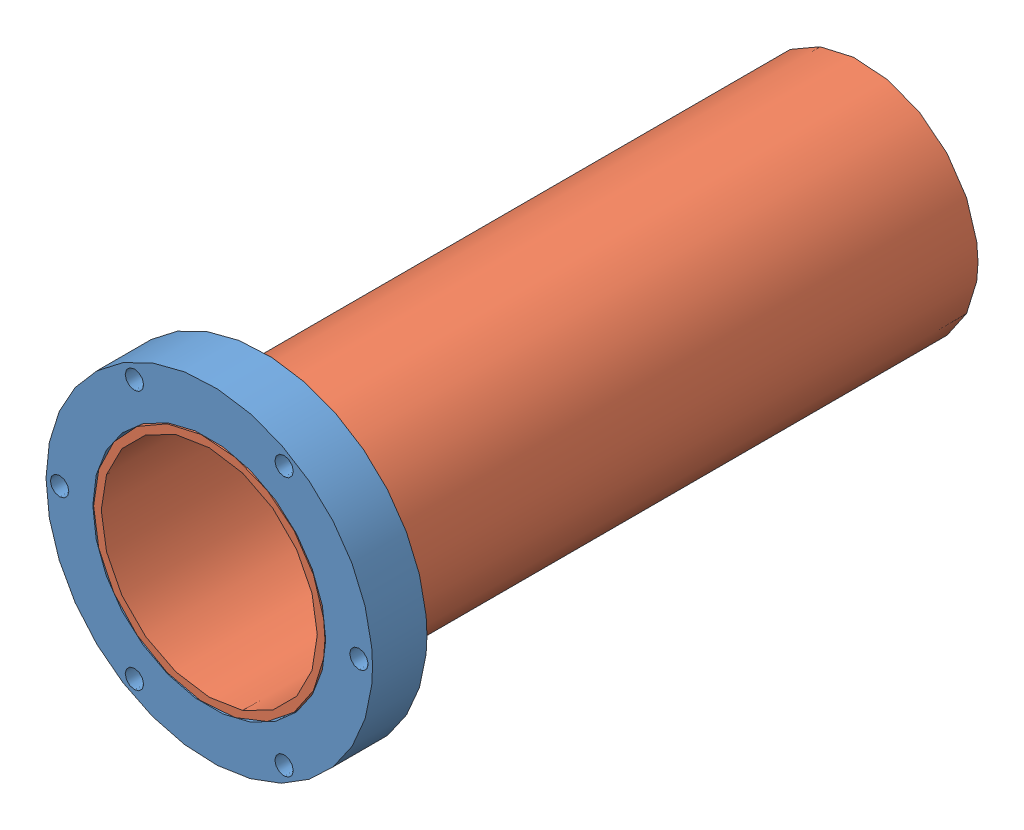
SolidWorks assembly Snoot Stub.SLDASM, configuration Default (file format 13000). Lengths in mm.
Overall size (76.2 76.2 152.4).
3 component instances, 3 part files, 6 mates.
Components (placement in the parent):
- Stub Flange-1: Stub Flange.SLDPRT [Default] at (5.1358 52.0834 60.2585) size (76.2 76.2 12.7)
- Snoot Tube Snub-1: Snoot Tube Snub.SLDPRT [Default] at (5.1358 52.0834 -79.4415) size (53.98 53.98 152.4)
- 9464K361_Chemical-Resistant Viton Fluoroelastomer O-Ring-1: 9464K361_Chemical-Resistant Viton Fluoroelastomer O-Ring.SLDPRT [9464K361] at (5.1358 52.0834 61.1475) size (63.6 63.6 1.32)
Mates (geometry in assembly coordinates):
- Concentric1: concentric aligned: cylinder of Stub Flange-1 through (5.1358 52.0834 72.9585) axis (0 0 -1) radius 27.178; cylinder of Snoot Tube Snub-1 through (5.1358 52.0834 72.9585) axis (0 0 -1) radius 26.9875
- Concentric2: concentric aligned: circle of Stub Flange-1; circle of 1320N81_Metal Detector Grade Fluoroelastomer O-Ring-1
- Coincident1: coincident anti-aligned: plane of Stub Flange-1 through (5.1358 52.0834 61.5793) normal (0 0 -1); plane of 1320N81_Metal Detector Grade Fluoroelastomer O-Ring-1 through (5.1358 52.0834 61.5793) normal (0 0 1)
- Coincident2: coincident aligned: plane of Stub Flange-1 through (5.1358 52.0834 72.9585) normal (0 0 1); plane of Snoot Tube Snub-1 through (5.1358 52.0834 72.9585) normal (0 0 1)
- Concentric3: concentric anti-aligned: cylinder of Stub Flange-1 through (5.1358 52.0834 61.5793) axis (0 0 -1) radius 29.1592; circle of 9464K361_Chemical-Resistant Viton Fluoroelastomer O-Ring-1
- Coincident4: coincident anti-aligned: plane of Stub Flange-1 through (5.1358 52.0834 61.5793) normal (0 0 -1); plane of 9464K361_Chemical-Resistant Viton Fluoroelastomer O-Ring-1 through (5.1358 52.0834 61.5793) normal (0 0 1)
